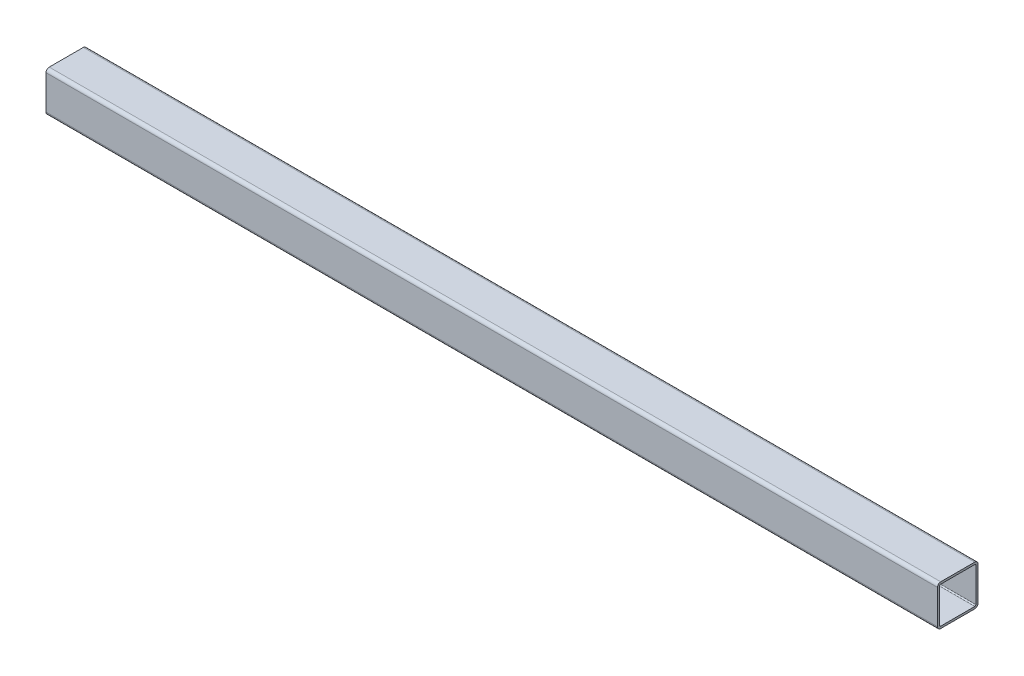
ISO-10303-21;
HEADER;
FILE_DESCRIPTION(('STEP AP214'),'2;1');
FILE_NAME('part.step','',(''),(''),'','','');
FILE_SCHEMA(('AUTOMOTIVE_DESIGN { 1 0 10303 214 1 1 1 1 }'));
ENDSEC;
DATA;
#1=APPLICATION_CONTEXT('core data for automotive mechanical design processes');
#2=APPLICATION_PROTOCOL_DEFINITION('international standard','automotive_design',2000,#1);
#3=PRODUCT_CONTEXT('',#1,'mechanical');
#4=PRODUCT('Part','Part','',(#3));
#5=PRODUCT_RELATED_PRODUCT_CATEGORY('part','',(#4));
#6=PRODUCT_DEFINITION_FORMATION('','',#4);
#7=PRODUCT_DEFINITION_CONTEXT('part definition',#1,'design');
#8=PRODUCT_DEFINITION('design','',#6,#7);
#9=PRODUCT_DEFINITION_SHAPE('','',#8);
#10=(LENGTH_UNIT() NAMED_UNIT(*) SI_UNIT(.MILLI.,.METRE.));
#11=(NAMED_UNIT(*) PLANE_ANGLE_UNIT() SI_UNIT($,.RADIAN.));
#12=(NAMED_UNIT(*) SI_UNIT($,.STERADIAN.) SOLID_ANGLE_UNIT());
#13=UNCERTAINTY_MEASURE_WITH_UNIT(LENGTH_MEASURE(1.E-05),#10,'distance_accuracy_value','');
#14=(GEOMETRIC_REPRESENTATION_CONTEXT(3) GLOBAL_UNCERTAINTY_ASSIGNED_CONTEXT((#13)) GLOBAL_UNIT_ASSIGNED_CONTEXT((#10,
#11,#12)) REPRESENTATION_CONTEXT('',''));
#15=CARTESIAN_POINT('',(0.,0.,0.));
#16=DIRECTION('',(0.,0.,1.));
#17=DIRECTION('',(1.,0.,0.));
#18=AXIS2_PLACEMENT_3D('',#15,#16,#17);
#19=CARTESIAN_POINT('',(698.5,2.54,29.21));
#20=DIRECTION('',(1.,0.,0.));
#21=DIRECTION('',(0.,0.,-1.));
#22=AXIS2_PLACEMENT_3D('',#19,#20,#21);
#23=PLANE('',#22);
#24=CARTESIAN_POINT('',(698.5,2.54,29.21));
#25=DIRECTION('',(1.,0.,0.));
#26=DIRECTION('',(0.,0.,-1.));
#27=AXIS2_PLACEMENT_3D('',#24,#25,#26);
#28=CIRCLE('',#27,2.54);
#29=CARTESIAN_POINT('',(698.5,2.54000000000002,31.75));
#30=VERTEX_POINT('',#29);
#31=CARTESIAN_POINT('',(698.5,0.,29.21));
#32=VERTEX_POINT('',#31);
#33=EDGE_CURVE('E219',#30,#32,#28,.T.);
#34=ORIENTED_EDGE('',*,*,#33,.T.);
#35=DIRECTION('',(0.,0.,-1.));
#36=VECTOR('',#35,1.);
#37=CARTESIAN_POINT('',(698.5,0.,29.21));
#38=LINE('',#37,#36);
#39=CARTESIAN_POINT('',(698.5,0.,2.54000000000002));
#40=VERTEX_POINT('',#39);
#41=EDGE_CURVE('E222',#32,#40,#38,.T.);
#42=ORIENTED_EDGE('',*,*,#41,.T.);
#43=CARTESIAN_POINT('',(698.5,2.54,2.54));
#44=DIRECTION('',(1.,0.,0.));
#45=DIRECTION('',(0.,0.,1.));
#46=AXIS2_PLACEMENT_3D('',#43,#44,#45);
#47=CIRCLE('',#46,2.54);
#48=CARTESIAN_POINT('',(698.5,2.54000000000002,0.));
#49=VERTEX_POINT('',#48);
#50=EDGE_CURVE('E225',#40,#49,#47,.T.);
#51=ORIENTED_EDGE('',*,*,#50,.T.);
#52=DIRECTION('',(0.,1.,0.));
#53=VECTOR('',#52,1.);
#54=CARTESIAN_POINT('',(698.5,2.54000000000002,0.));
#55=LINE('',#54,#53);
#56=CARTESIAN_POINT('',(698.5,29.21,0.));
#57=VERTEX_POINT('',#56);
#58=EDGE_CURVE('E227',#49,#57,#55,.T.);
#59=ORIENTED_EDGE('',*,*,#58,.T.);
#60=CARTESIAN_POINT('',(698.5,29.21,2.54));
#61=DIRECTION('',(1.,0.,0.));
#62=DIRECTION('',(0.,0.,-1.));
#63=AXIS2_PLACEMENT_3D('',#60,#61,#62);
#64=CIRCLE('',#63,2.54);
#65=CARTESIAN_POINT('',(698.5,31.75,2.54000000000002));
#66=VERTEX_POINT('',#65);
#67=EDGE_CURVE('E229',#57,#66,#64,.T.);
#68=ORIENTED_EDGE('',*,*,#67,.T.);
#69=DIRECTION('',(0.,0.,1.));
#70=VECTOR('',#69,1.);
#71=CARTESIAN_POINT('',(698.5,31.75,2.54000000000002));
#72=LINE('',#71,#70);
#73=CARTESIAN_POINT('',(698.5,31.75,29.21));
#74=VERTEX_POINT('',#73);
#75=EDGE_CURVE('E231',#66,#74,#72,.T.);
#76=ORIENTED_EDGE('',*,*,#75,.T.);
#77=CARTESIAN_POINT('',(698.5,29.21,29.21));
#78=DIRECTION('',(1.,0.,0.));
#79=DIRECTION('',(0.,0.,1.));
#80=AXIS2_PLACEMENT_3D('',#77,#78,#79);
#81=CIRCLE('',#80,2.54);
#82=CARTESIAN_POINT('',(698.5,29.21,31.75));
#83=VERTEX_POINT('',#82);
#84=EDGE_CURVE('E233',#74,#83,#81,.T.);
#85=ORIENTED_EDGE('',*,*,#84,.T.);
#86=DIRECTION('',(0.,-1.,0.));
#87=VECTOR('',#86,1.);
#88=CARTESIAN_POINT('',(698.5,29.21,31.75));
#89=LINE('',#88,#87);
#90=EDGE_CURVE('E235',#83,#30,#89,.T.);
#91=ORIENTED_EDGE('',*,*,#90,.T.);
#92=EDGE_LOOP('',(#34,#42,#51,#59,#68,#76,#85,#91));
#93=FACE_BOUND('',#92,.T.);
#94=DIRECTION('',(0.,1.,0.));
#95=VECTOR('',#94,1.);
#96=CARTESIAN_POINT('',(698.5,2.54000000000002,1.651));
#97=LINE('',#96,#95);
#98=CARTESIAN_POINT('',(698.5,2.54000000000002,1.651));
#99=VERTEX_POINT('',#98);
#100=CARTESIAN_POINT('',(698.5,29.21,1.651));
#101=VERTEX_POINT('',#100);
#102=EDGE_CURVE('E162',#99,#101,#97,.T.);
#103=ORIENTED_EDGE('',*,*,#102,.F.);
#104=CARTESIAN_POINT('',(698.5,2.54,2.54));
#105=DIRECTION('',(1.,0.,0.));
#106=DIRECTION('',(0.,0.,1.));
#107=AXIS2_PLACEMENT_3D('',#104,#105,#106);
#108=CIRCLE('',#107,0.889);
#109=CARTESIAN_POINT('',(698.5,1.651,2.54000000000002));
#110=VERTEX_POINT('',#109);
#111=EDGE_CURVE('E154',#110,#99,#108,.T.);
#112=ORIENTED_EDGE('',*,*,#111,.F.);
#113=DIRECTION('',(0.,0.,-1.));
#114=VECTOR('',#113,1.);
#115=CARTESIAN_POINT('',(698.5,1.651,29.21));
#116=LINE('',#115,#114);
#117=CARTESIAN_POINT('',(698.5,1.651,29.21));
#118=VERTEX_POINT('',#117);
#119=EDGE_CURVE('E187',#118,#110,#116,.T.);
#120=ORIENTED_EDGE('',*,*,#119,.F.);
#121=CARTESIAN_POINT('',(698.5,2.54,29.21));
#122=DIRECTION('',(1.,0.,0.));
#123=DIRECTION('',(0.,0.,-1.));
#124=AXIS2_PLACEMENT_3D('',#121,#122,#123);
#125=CIRCLE('',#124,0.889000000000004);
#126=CARTESIAN_POINT('',(698.5,2.54000000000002,30.099));
#127=VERTEX_POINT('',#126);
#128=EDGE_CURVE('E185',#127,#118,#125,.T.);
#129=ORIENTED_EDGE('',*,*,#128,.F.);
#130=DIRECTION('',(0.,-1.,0.));
#131=VECTOR('',#130,1.);
#132=CARTESIAN_POINT('',(698.5,29.21,30.099));
#133=LINE('',#132,#131);
#134=CARTESIAN_POINT('',(698.5,29.21,30.099));
#135=VERTEX_POINT('',#134);
#136=EDGE_CURVE('E183',#135,#127,#133,.T.);
#137=ORIENTED_EDGE('',*,*,#136,.F.);
#138=CARTESIAN_POINT('',(698.5,29.21,29.21));
#139=DIRECTION('',(1.,0.,0.));
#140=DIRECTION('',(0.,0.,1.));
#141=AXIS2_PLACEMENT_3D('',#138,#139,#140);
#142=CIRCLE('',#141,0.889000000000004);
#143=CARTESIAN_POINT('',(698.5,30.099,29.21));
#144=VERTEX_POINT('',#143);
#145=EDGE_CURVE('E181',#144,#135,#142,.T.);
#146=ORIENTED_EDGE('',*,*,#145,.F.);
#147=DIRECTION('',(0.,0.,1.));
#148=VECTOR('',#147,1.);
#149=CARTESIAN_POINT('',(698.5,30.099,2.54000000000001));
#150=LINE('',#149,#148);
#151=CARTESIAN_POINT('',(698.5,30.099,2.54000000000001));
#152=VERTEX_POINT('',#151);
#153=EDGE_CURVE('E177',#152,#144,#150,.T.);
#154=ORIENTED_EDGE('',*,*,#153,.F.);
#155=CARTESIAN_POINT('',(698.5,29.21,2.54));
#156=DIRECTION('',(1.,0.,0.));
#157=DIRECTION('',(0.,0.,-1.));
#158=AXIS2_PLACEMENT_3D('',#155,#156,#157);
#159=CIRCLE('',#158,0.889);
#160=EDGE_CURVE('E175',#101,#152,#159,.T.);
#161=ORIENTED_EDGE('',*,*,#160,.F.);
#162=EDGE_LOOP('',(#103,#112,#120,#129,#137,#146,#154,#161));
#163=FACE_BOUND('',#162,.T.);
#164=ADVANCED_FACE('F41',(#93,#163),#23,.T.);
#165=CARTESIAN_POINT('',(0.,2.54,29.21));
#166=DIRECTION('',(1.,0.,0.));
#167=DIRECTION('',(0.,0.,-1.));
#168=AXIS2_PLACEMENT_3D('',#165,#166,#167);
#169=PLANE('',#168);
#170=CARTESIAN_POINT('',(0.,2.54,29.21));
#171=DIRECTION('',(1.,0.,0.));
#172=DIRECTION('',(0.,0.,-1.));
#173=AXIS2_PLACEMENT_3D('',#170,#171,#172);
#174=CIRCLE('',#173,2.54);
#175=CARTESIAN_POINT('',(0.,2.54000000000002,31.75));
#176=VERTEX_POINT('',#175);
#177=CARTESIAN_POINT('',(0.,0.,29.21));
#178=VERTEX_POINT('',#177);
#179=EDGE_CURVE('E170',#176,#178,#174,.T.);
#180=ORIENTED_EDGE('',*,*,#179,.F.);
#181=DIRECTION('',(0.,-1.,0.));
#182=VECTOR('',#181,1.);
#183=CARTESIAN_POINT('',(0.,29.21,31.75));
#184=LINE('',#183,#182);
#185=CARTESIAN_POINT('',(0.,29.21,31.75));
#186=VERTEX_POINT('',#185);
#187=EDGE_CURVE('E223',#186,#176,#184,.T.);
#188=ORIENTED_EDGE('',*,*,#187,.F.);
#189=CARTESIAN_POINT('',(0.,29.21,29.21));
#190=DIRECTION('',(1.,0.,0.));
#191=DIRECTION('',(0.,0.,1.));
#192=AXIS2_PLACEMENT_3D('',#189,#190,#191);
#193=CIRCLE('',#192,2.54);
#194=CARTESIAN_POINT('',(0.,31.75,29.21));
#195=VERTEX_POINT('',#194);
#196=EDGE_CURVE('E250',#195,#186,#193,.T.);
#197=ORIENTED_EDGE('',*,*,#196,.F.);
#198=DIRECTION('',(0.,0.,1.));
#199=VECTOR('',#198,1.);
#200=CARTESIAN_POINT('',(0.,31.75,2.54000000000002));
#201=LINE('',#200,#199);
#202=CARTESIAN_POINT('',(0.,31.75,2.54000000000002));
#203=VERTEX_POINT('',#202);
#204=EDGE_CURVE('E248',#203,#195,#201,.T.);
#205=ORIENTED_EDGE('',*,*,#204,.F.);
#206=CARTESIAN_POINT('',(0.,29.21,2.54));
#207=DIRECTION('',(1.,0.,0.));
#208=DIRECTION('',(0.,0.,-1.));
#209=AXIS2_PLACEMENT_3D('',#206,#207,#208);
#210=CIRCLE('',#209,2.54);
#211=CARTESIAN_POINT('',(0.,29.21,0.));
#212=VERTEX_POINT('',#211);
#213=EDGE_CURVE('E246',#212,#203,#210,.T.);
#214=ORIENTED_EDGE('',*,*,#213,.F.);
#215=DIRECTION('',(0.,1.,0.));
#216=VECTOR('',#215,1.);
#217=CARTESIAN_POINT('',(0.,2.54000000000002,0.));
#218=LINE('',#217,#216);
#219=CARTESIAN_POINT('',(0.,2.54000000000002,0.));
#220=VERTEX_POINT('',#219);
#221=EDGE_CURVE('E244',#220,#212,#218,.T.);
#222=ORIENTED_EDGE('',*,*,#221,.F.);
#223=CARTESIAN_POINT('',(0.,2.54,2.54));
#224=DIRECTION('',(1.,0.,0.));
#225=DIRECTION('',(0.,0.,1.));
#226=AXIS2_PLACEMENT_3D('',#223,#224,#225);
#227=CIRCLE('',#226,2.54);
#228=CARTESIAN_POINT('',(0.,0.,2.54000000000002));
#229=VERTEX_POINT('',#228);
#230=EDGE_CURVE('E242',#229,#220,#227,.T.);
#231=ORIENTED_EDGE('',*,*,#230,.F.);
#232=DIRECTION('',(0.,0.,-1.));
#233=VECTOR('',#232,1.);
#234=CARTESIAN_POINT('',(0.,0.,29.21));
#235=LINE('',#234,#233);
#236=EDGE_CURVE('E240',#178,#229,#235,.T.);
#237=ORIENTED_EDGE('',*,*,#236,.F.);
#238=EDGE_LOOP('',(#180,#188,#197,#205,#214,#222,#231,#237));
#239=FACE_BOUND('',#238,.T.);
#240=CARTESIAN_POINT('',(0.,2.54,2.54));
#241=DIRECTION('',(1.,0.,0.));
#242=DIRECTION('',(0.,0.,1.));
#243=AXIS2_PLACEMENT_3D('',#240,#241,#242);
#244=CIRCLE('',#243,0.889);
#245=CARTESIAN_POINT('',(0.,1.651,2.54000000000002));
#246=VERTEX_POINT('',#245);
#247=CARTESIAN_POINT('',(0.,2.54000000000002,1.651));
#248=VERTEX_POINT('',#247);
#249=EDGE_CURVE('E64',#246,#248,#244,.T.);
#250=ORIENTED_EDGE('',*,*,#249,.T.);
#251=DIRECTION('',(0.,1.,0.));
#252=VECTOR('',#251,1.);
#253=CARTESIAN_POINT('',(0.,2.54000000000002,1.651));
#254=LINE('',#253,#252);
#255=CARTESIAN_POINT('',(0.,29.21,1.651));
#256=VERTEX_POINT('',#255);
#257=EDGE_CURVE('E169',#248,#256,#254,.T.);
#258=ORIENTED_EDGE('',*,*,#257,.T.);
#259=CARTESIAN_POINT('',(0.,29.21,2.54));
#260=DIRECTION('',(1.,0.,0.));
#261=DIRECTION('',(0.,0.,-1.));
#262=AXIS2_PLACEMENT_3D('',#259,#260,#261);
#263=CIRCLE('',#262,0.889);
#264=CARTESIAN_POINT('',(0.,30.099,2.54000000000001));
#265=VERTEX_POINT('',#264);
#266=EDGE_CURVE('E191',#256,#265,#263,.T.);
#267=ORIENTED_EDGE('',*,*,#266,.T.);
#268=DIRECTION('',(0.,0.,1.));
#269=VECTOR('',#268,1.);
#270=CARTESIAN_POINT('',(0.,30.099,2.54000000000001));
#271=LINE('',#270,#269);
#272=CARTESIAN_POINT('',(0.,30.099,29.21));
#273=VERTEX_POINT('',#272);
#274=EDGE_CURVE('E194',#265,#273,#271,.T.);
#275=ORIENTED_EDGE('',*,*,#274,.T.);
#276=CARTESIAN_POINT('',(0.,29.21,29.21));
#277=DIRECTION('',(1.,0.,0.));
#278=DIRECTION('',(0.,0.,1.));
#279=AXIS2_PLACEMENT_3D('',#276,#277,#278);
#280=CIRCLE('',#279,0.889000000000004);
#281=CARTESIAN_POINT('',(0.,29.21,30.099));
#282=VERTEX_POINT('',#281);
#283=EDGE_CURVE('E197',#273,#282,#280,.T.);
#284=ORIENTED_EDGE('',*,*,#283,.T.);
#285=DIRECTION('',(0.,-1.,0.));
#286=VECTOR('',#285,1.);
#287=CARTESIAN_POINT('',(0.,29.21,30.099));
#288=LINE('',#287,#286);
#289=CARTESIAN_POINT('',(0.,2.54000000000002,30.099));
#290=VERTEX_POINT('',#289);
#291=EDGE_CURVE('E200',#282,#290,#288,.T.);
#292=ORIENTED_EDGE('',*,*,#291,.T.);
#293=CARTESIAN_POINT('',(0.,2.54,29.21));
#294=DIRECTION('',(1.,0.,0.));
#295=DIRECTION('',(0.,0.,-1.));
#296=AXIS2_PLACEMENT_3D('',#293,#294,#295);
#297=CIRCLE('',#296,0.889000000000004);
#298=CARTESIAN_POINT('',(0.,1.651,29.21));
#299=VERTEX_POINT('',#298);
#300=EDGE_CURVE('E203',#290,#299,#297,.T.);
#301=ORIENTED_EDGE('',*,*,#300,.T.);
#302=DIRECTION('',(0.,0.,-1.));
#303=VECTOR('',#302,1.);
#304=CARTESIAN_POINT('',(0.,1.651,29.21));
#305=LINE('',#304,#303);
#306=EDGE_CURVE('E163',#299,#246,#305,.T.);
#307=ORIENTED_EDGE('',*,*,#306,.T.);
#308=EDGE_LOOP('',(#250,#258,#267,#275,#284,#292,#301,#307));
#309=FACE_BOUND('',#308,.T.);
#310=ADVANCED_FACE('F280',(#239,#309),#169,.F.);
#311=CARTESIAN_POINT('',(698.5,2.54,29.21));
#312=DIRECTION('',(-1.,0.,0.));
#313=DIRECTION('',(0.,0.,1.));
#314=AXIS2_PLACEMENT_3D('',#311,#312,#313);
#315=CYLINDRICAL_SURFACE('',#314,2.54);
#316=ORIENTED_EDGE('',*,*,#179,.T.);
#317=DIRECTION('',(-1.,0.,0.));
#318=VECTOR('',#317,1.);
#319=CARTESIAN_POINT('',(698.5,0.,29.21));
#320=LINE('',#319,#318);
#321=EDGE_CURVE('E11',#32,#178,#320,.T.);
#322=ORIENTED_EDGE('',*,*,#321,.F.);
#323=ORIENTED_EDGE('',*,*,#33,.F.);
#324=DIRECTION('',(-1.,0.,0.));
#325=VECTOR('',#324,1.);
#326=CARTESIAN_POINT('',(698.5,2.54000000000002,31.75));
#327=LINE('',#326,#325);
#328=EDGE_CURVE('E237',#30,#176,#327,.T.);
#329=ORIENTED_EDGE('',*,*,#328,.T.);
#330=EDGE_LOOP('',(#316,#322,#323,#329));
#331=FACE_BOUND('',#330,.T.);
#332=ADVANCED_FACE('F43',(#331),#315,.T.);
#333=CARTESIAN_POINT('',(698.5,0.,29.21));
#334=DIRECTION('',(0.,1.,0.));
#335=DIRECTION('',(0.,0.,1.));
#336=AXIS2_PLACEMENT_3D('',#333,#334,#335);
#337=PLANE('',#336);
#338=ORIENTED_EDGE('',*,*,#236,.T.);
#339=DIRECTION('',(-1.,0.,0.));
#340=VECTOR('',#339,1.);
#341=CARTESIAN_POINT('',(698.5,0.,2.54000000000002));
#342=LINE('',#341,#340);
#343=EDGE_CURVE('E49',#40,#229,#342,.T.);
#344=ORIENTED_EDGE('',*,*,#343,.F.);
#345=ORIENTED_EDGE('',*,*,#41,.F.);
#346=ORIENTED_EDGE('',*,*,#321,.T.);
#347=EDGE_LOOP('',(#338,#344,#345,#346));
#348=FACE_BOUND('',#347,.T.);
#349=ADVANCED_FACE('F297',(#348),#337,.F.);
#350=CARTESIAN_POINT('',(698.5,2.54,2.54));
#351=DIRECTION('',(-1.,0.,0.));
#352=DIRECTION('',(0.,0.,1.));
#353=AXIS2_PLACEMENT_3D('',#350,#351,#352);
#354=CYLINDRICAL_SURFACE('',#353,2.54);
#355=ORIENTED_EDGE('',*,*,#230,.T.);
#356=DIRECTION('',(-1.,0.,0.));
#357=VECTOR('',#356,1.);
#358=CARTESIAN_POINT('',(698.5,2.54000000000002,0.));
#359=LINE('',#358,#357);
#360=EDGE_CURVE('E267',#49,#220,#359,.T.);
#361=ORIENTED_EDGE('',*,*,#360,.F.);
#362=ORIENTED_EDGE('',*,*,#50,.F.);
#363=ORIENTED_EDGE('',*,*,#343,.T.);
#364=EDGE_LOOP('',(#355,#361,#362,#363));
#365=FACE_BOUND('',#364,.T.);
#366=ADVANCED_FACE('F274',(#365),#354,.T.);
#367=CARTESIAN_POINT('',(698.5,2.54000000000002,0.));
#368=DIRECTION('',(0.,0.,1.));
#369=DIRECTION('',(1.,0.,0.));
#370=AXIS2_PLACEMENT_3D('',#367,#368,#369);
#371=PLANE('',#370);
#372=ORIENTED_EDGE('',*,*,#221,.T.);
#373=DIRECTION('',(-1.,0.,0.));
#374=VECTOR('',#373,1.);
#375=CARTESIAN_POINT('',(698.5,29.21,0.));
#376=LINE('',#375,#374);
#377=EDGE_CURVE('E264',#57,#212,#376,.T.);
#378=ORIENTED_EDGE('',*,*,#377,.F.);
#379=ORIENTED_EDGE('',*,*,#58,.F.);
#380=ORIENTED_EDGE('',*,*,#360,.T.);
#381=EDGE_LOOP('',(#372,#378,#379,#380));
#382=FACE_BOUND('',#381,.T.);
#383=ADVANCED_FACE('F286',(#382),#371,.F.);
#384=CARTESIAN_POINT('',(698.5,29.21,2.54));
#385=DIRECTION('',(-1.,0.,0.));
#386=DIRECTION('',(0.,0.,1.));
#387=AXIS2_PLACEMENT_3D('',#384,#385,#386);
#388=CYLINDRICAL_SURFACE('',#387,2.54);
#389=ORIENTED_EDGE('',*,*,#213,.T.);
#390=DIRECTION('',(-1.,0.,0.));
#391=VECTOR('',#390,1.);
#392=CARTESIAN_POINT('',(698.5,31.75,2.54000000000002));
#393=LINE('',#392,#391);
#394=EDGE_CURVE('E261',#66,#203,#393,.T.);
#395=ORIENTED_EDGE('',*,*,#394,.F.);
#396=ORIENTED_EDGE('',*,*,#67,.F.);
#397=ORIENTED_EDGE('',*,*,#377,.T.);
#398=EDGE_LOOP('',(#389,#395,#396,#397));
#399=FACE_BOUND('',#398,.T.);
#400=ADVANCED_FACE('F290',(#399),#388,.T.);
#401=CARTESIAN_POINT('',(698.5,31.75,2.54000000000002));
#402=DIRECTION('',(0.,-1.,0.));
#403=DIRECTION('',(0.,0.,-1.));
#404=AXIS2_PLACEMENT_3D('',#401,#402,#403);
#405=PLANE('',#404);
#406=ORIENTED_EDGE('',*,*,#204,.T.);
#407=DIRECTION('',(-1.,0.,0.));
#408=VECTOR('',#407,1.);
#409=CARTESIAN_POINT('',(698.5,31.75,29.21));
#410=LINE('',#409,#408);
#411=EDGE_CURVE('E258',#74,#195,#410,.T.);
#412=ORIENTED_EDGE('',*,*,#411,.F.);
#413=ORIENTED_EDGE('',*,*,#75,.F.);
#414=ORIENTED_EDGE('',*,*,#394,.T.);
#415=EDGE_LOOP('',(#406,#412,#413,#414));
#416=FACE_BOUND('',#415,.T.);
#417=ADVANCED_FACE('F310',(#416),#405,.F.);
#418=CARTESIAN_POINT('',(698.5,29.21,29.21));
#419=DIRECTION('',(-1.,0.,0.));
#420=DIRECTION('',(0.,0.,1.));
#421=AXIS2_PLACEMENT_3D('',#418,#419,#420);
#422=CYLINDRICAL_SURFACE('',#421,2.54);
#423=ORIENTED_EDGE('',*,*,#196,.T.);
#424=DIRECTION('',(-1.,0.,0.));
#425=VECTOR('',#424,1.);
#426=CARTESIAN_POINT('',(698.5,29.21,31.75));
#427=LINE('',#426,#425);
#428=EDGE_CURVE('E255',#83,#186,#427,.T.);
#429=ORIENTED_EDGE('',*,*,#428,.F.);
#430=ORIENTED_EDGE('',*,*,#84,.F.);
#431=ORIENTED_EDGE('',*,*,#411,.T.);
#432=EDGE_LOOP('',(#423,#429,#430,#431));
#433=FACE_BOUND('',#432,.T.);
#434=ADVANCED_FACE('F308',(#433),#422,.T.);
#435=CARTESIAN_POINT('',(698.5,29.21,31.75));
#436=DIRECTION('',(0.,0.,-1.));
#437=DIRECTION('',(0.,1.,0.));
#438=AXIS2_PLACEMENT_3D('',#435,#436,#437);
#439=PLANE('',#438);
#440=ORIENTED_EDGE('',*,*,#187,.T.);
#441=ORIENTED_EDGE('',*,*,#328,.F.);
#442=ORIENTED_EDGE('',*,*,#90,.F.);
#443=ORIENTED_EDGE('',*,*,#428,.T.);
#444=EDGE_LOOP('',(#440,#441,#442,#443));
#445=FACE_BOUND('',#444,.T.);
#446=ADVANCED_FACE('F303',(#445),#439,.F.);
#447=CARTESIAN_POINT('',(698.5,2.54,2.54));
#448=DIRECTION('',(-1.,0.,0.));
#449=DIRECTION('',(0.,0.,1.));
#450=AXIS2_PLACEMENT_3D('',#447,#448,#449);
#451=CYLINDRICAL_SURFACE('',#450,0.889);
#452=ORIENTED_EDGE('',*,*,#249,.F.);
#453=DIRECTION('',(-1.,0.,0.));
#454=VECTOR('',#453,1.);
#455=CARTESIAN_POINT('',(698.5,1.651,2.54000000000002));
#456=LINE('',#455,#454);
#457=EDGE_CURVE('E158',#110,#246,#456,.T.);
#458=ORIENTED_EDGE('',*,*,#457,.F.);
#459=ORIENTED_EDGE('',*,*,#111,.T.);
#460=DIRECTION('',(-1.,0.,0.));
#461=VECTOR('',#460,1.);
#462=CARTESIAN_POINT('',(698.5,2.54000000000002,1.651));
#463=LINE('',#462,#461);
#464=EDGE_CURVE('E157',#99,#248,#463,.T.);
#465=ORIENTED_EDGE('',*,*,#464,.T.);
#466=EDGE_LOOP('',(#452,#458,#459,#465));
#467=FACE_BOUND('',#466,.T.);
#468=ADVANCED_FACE('F156',(#467),#451,.F.);
#469=CARTESIAN_POINT('',(698.5,2.54000000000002,1.651));
#470=DIRECTION('',(0.,0.,1.));
#471=DIRECTION('',(1.,0.,0.));
#472=AXIS2_PLACEMENT_3D('',#469,#470,#471);
#473=PLANE('',#472);
#474=ORIENTED_EDGE('',*,*,#257,.F.);
#475=ORIENTED_EDGE('',*,*,#464,.F.);
#476=ORIENTED_EDGE('',*,*,#102,.T.);
#477=DIRECTION('',(-1.,0.,0.));
#478=VECTOR('',#477,1.);
#479=CARTESIAN_POINT('',(698.5,29.21,1.651));
#480=LINE('',#479,#478);
#481=EDGE_CURVE('E171',#101,#256,#480,.T.);
#482=ORIENTED_EDGE('',*,*,#481,.T.);
#483=EDGE_LOOP('',(#474,#475,#476,#482));
#484=FACE_BOUND('',#483,.T.);
#485=ADVANCED_FACE('F166',(#484),#473,.T.);
#486=CARTESIAN_POINT('',(698.5,29.21,2.54));
#487=DIRECTION('',(-1.,0.,0.));
#488=DIRECTION('',(0.,0.,1.));
#489=AXIS2_PLACEMENT_3D('',#486,#487,#488);
#490=CYLINDRICAL_SURFACE('',#489,0.889);
#491=ORIENTED_EDGE('',*,*,#266,.F.);
#492=ORIENTED_EDGE('',*,*,#481,.F.);
#493=ORIENTED_EDGE('',*,*,#160,.T.);
#494=DIRECTION('',(-1.,0.,0.));
#495=VECTOR('',#494,1.);
#496=CARTESIAN_POINT('',(698.5,30.099,2.54000000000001));
#497=LINE('',#496,#495);
#498=EDGE_CURVE('E216',#152,#265,#497,.T.);
#499=ORIENTED_EDGE('',*,*,#498,.T.);
#500=EDGE_LOOP('',(#491,#492,#493,#499));
#501=FACE_BOUND('',#500,.T.);
#502=ADVANCED_FACE('F335',(#501),#490,.F.);
#503=CARTESIAN_POINT('',(698.5,30.099,2.54000000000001));
#504=DIRECTION('',(0.,-1.,0.));
#505=DIRECTION('',(0.,0.,-1.));
#506=AXIS2_PLACEMENT_3D('',#503,#504,#505);
#507=PLANE('',#506);
#508=ORIENTED_EDGE('',*,*,#274,.F.);
#509=ORIENTED_EDGE('',*,*,#498,.F.);
#510=ORIENTED_EDGE('',*,*,#153,.T.);
#511=DIRECTION('',(-1.,0.,0.));
#512=VECTOR('',#511,1.);
#513=CARTESIAN_POINT('',(698.5,30.099,29.21));
#514=LINE('',#513,#512);
#515=EDGE_CURVE('E214',#144,#273,#514,.T.);
#516=ORIENTED_EDGE('',*,*,#515,.T.);
#517=EDGE_LOOP('',(#508,#509,#510,#516));
#518=FACE_BOUND('',#517,.T.);
#519=ADVANCED_FACE('F339',(#518),#507,.T.);
#520=CARTESIAN_POINT('',(698.5,29.21,29.21));
#521=DIRECTION('',(-1.,0.,0.));
#522=DIRECTION('',(0.,0.,1.));
#523=AXIS2_PLACEMENT_3D('',#520,#521,#522);
#524=CYLINDRICAL_SURFACE('',#523,0.889000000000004);
#525=ORIENTED_EDGE('',*,*,#283,.F.);
#526=ORIENTED_EDGE('',*,*,#515,.F.);
#527=ORIENTED_EDGE('',*,*,#145,.T.);
#528=DIRECTION('',(-1.,0.,0.));
#529=VECTOR('',#528,1.);
#530=CARTESIAN_POINT('',(698.5,29.21,30.099));
#531=LINE('',#530,#529);
#532=EDGE_CURVE('E212',#135,#282,#531,.T.);
#533=ORIENTED_EDGE('',*,*,#532,.T.);
#534=EDGE_LOOP('',(#525,#526,#527,#533));
#535=FACE_BOUND('',#534,.T.);
#536=ADVANCED_FACE('F345',(#535),#524,.F.);
#537=CARTESIAN_POINT('',(698.5,29.21,30.099));
#538=DIRECTION('',(0.,0.,-1.));
#539=DIRECTION('',(-1.,0.,0.));
#540=AXIS2_PLACEMENT_3D('',#537,#538,#539);
#541=PLANE('',#540);
#542=ORIENTED_EDGE('',*,*,#291,.F.);
#543=ORIENTED_EDGE('',*,*,#532,.F.);
#544=ORIENTED_EDGE('',*,*,#136,.T.);
#545=DIRECTION('',(-1.,0.,0.));
#546=VECTOR('',#545,1.);
#547=CARTESIAN_POINT('',(698.5,2.54000000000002,30.099));
#548=LINE('',#547,#546);
#549=EDGE_CURVE('E210',#127,#290,#548,.T.);
#550=ORIENTED_EDGE('',*,*,#549,.T.);
#551=EDGE_LOOP('',(#542,#543,#544,#550));
#552=FACE_BOUND('',#551,.T.);
#553=ADVANCED_FACE('F349',(#552),#541,.T.);
#554=CARTESIAN_POINT('',(698.5,2.54,29.21));
#555=DIRECTION('',(-1.,0.,0.));
#556=DIRECTION('',(0.,0.,1.));
#557=AXIS2_PLACEMENT_3D('',#554,#555,#556);
#558=CYLINDRICAL_SURFACE('',#557,0.889000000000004);
#559=ORIENTED_EDGE('',*,*,#300,.F.);
#560=ORIENTED_EDGE('',*,*,#549,.F.);
#561=ORIENTED_EDGE('',*,*,#128,.T.);
#562=DIRECTION('',(-1.,0.,0.));
#563=VECTOR('',#562,1.);
#564=CARTESIAN_POINT('',(698.5,1.651,29.21));
#565=LINE('',#564,#563);
#566=EDGE_CURVE('E56',#118,#299,#565,.T.);
#567=ORIENTED_EDGE('',*,*,#566,.T.);
#568=EDGE_LOOP('',(#559,#560,#561,#567));
#569=FACE_BOUND('',#568,.T.);
#570=ADVANCED_FACE('F353',(#569),#558,.F.);
#571=CARTESIAN_POINT('',(698.5,1.651,29.21));
#572=DIRECTION('',(0.,1.,0.));
#573=DIRECTION('',(0.,0.,1.));
#574=AXIS2_PLACEMENT_3D('',#571,#572,#573);
#575=PLANE('',#574);
#576=ORIENTED_EDGE('',*,*,#306,.F.);
#577=ORIENTED_EDGE('',*,*,#566,.F.);
#578=ORIENTED_EDGE('',*,*,#119,.T.);
#579=ORIENTED_EDGE('',*,*,#457,.T.);
#580=EDGE_LOOP('',(#576,#577,#578,#579));
#581=FACE_BOUND('',#580,.T.);
#582=ADVANCED_FACE('F357',(#581),#575,.T.);
#583=CLOSED_SHELL('',(#164,#310,#332,#349,#366,#383,#400,#417,#434,#446,#468,#485,#502,#519,
#536,#553,#570,#582));
#584=MANIFOLD_SOLID_BREP('B2',#583);
#585=ADVANCED_BREP_SHAPE_REPRESENTATION('',(#18,#584),#14);
#586=SHAPE_DEFINITION_REPRESENTATION(#9,#585);
ENDSEC;
END-ISO-10303-21;
